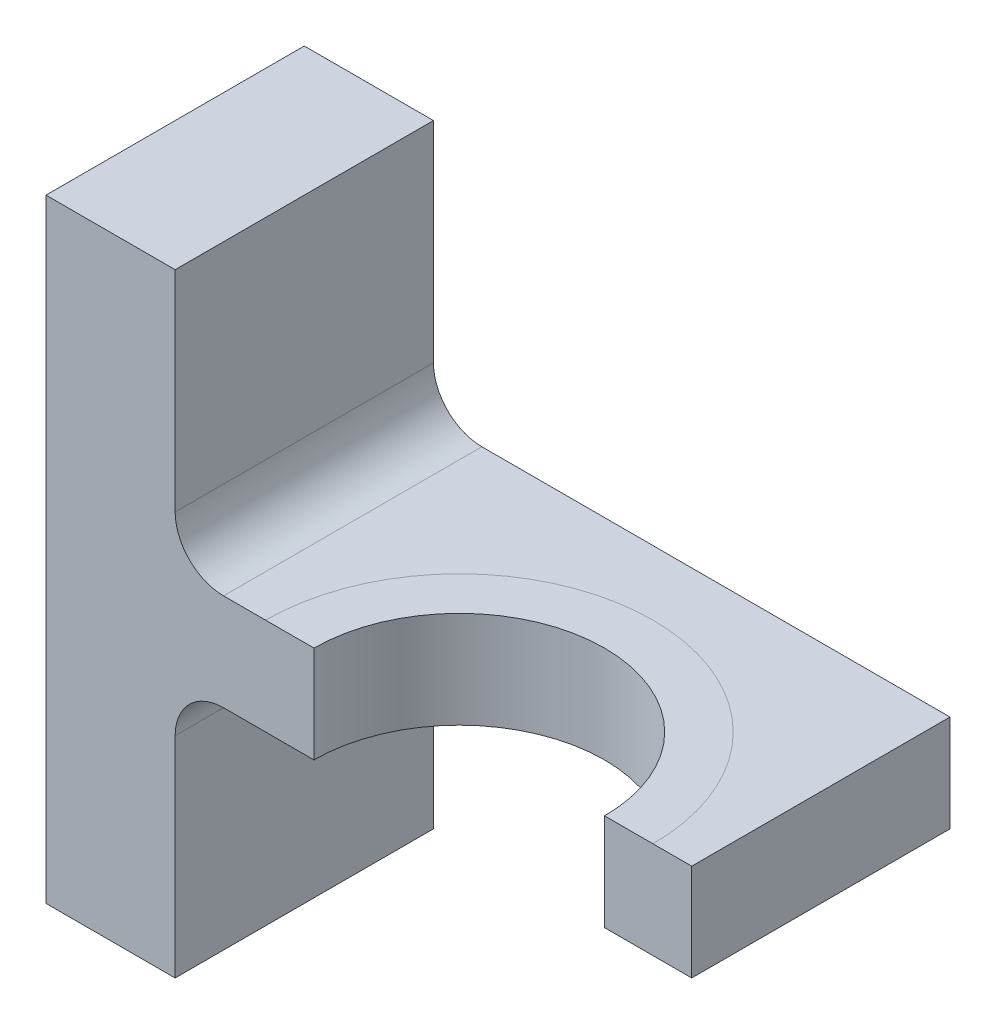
from build123d import *

# Parameters (mm, degrees)
BASE_EXTRUDE_DEPTH      = 50.8
CUT_EXTRUDE8_DEPTH      = 150.494968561
CUT_EXTRUDE8_DEPTH_BACK = 150.494968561
SKETCH6_R               = 28.575
FILLET6_R               = 9.525
SYMMETRY_CUT_DEPTH      = 150.494968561
SYMMETRY_CUT_DEPTH_BACK = 150.494968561


with BuildPart() as part:
    # Sketch1 → Base-Extrude (new, symmetric)
    with BuildSketch(Plane.XY):
        Polygon((0, -60.325), (25.4, -60.325), (25.4, -9.525), (127, -9.525), (127, 9.525), (25.4, 9.525), (25.4, 60.325), (0, 60.325), align=None)
    extrude(amount=BASE_EXTRUDE_DEPTH, both=True)

    # Sketch6 → Cut-Extrude8 (cut, two sides: drawn at the far end of the back side and taken through both)
    with BuildSketch(Plane(origin=(0, 0, 0), x_dir=(1, 0, 0), z_dir=(0, 1, 0)).offset(-CUT_EXTRUDE8_DEPTH_BACK)):
        with Locations(Location((81.28, 0, 0), (0, 0, 270))):
            Circle(SKETCH6_R)
    extrude(amount=CUT_EXTRUDE8_DEPTH + CUT_EXTRUDE8_DEPTH_BACK, mode=Mode.SUBTRACT)

    # Fillet6
    fillet6_edges = [part.edges().sort_by_distance(p)[0] for p in [
        (25.4, 9.525, 0),
        (25.4, -9.525, 0),
    ]]
    fillet(fillet6_edges, radius=FILLET6_R)

    # Sketch9 → symmetry cut (cut, two sides: drawn at the far end of the back side and taken through both)
    with BuildSketch(Plane(origin=(0, 0, 0), x_dir=(1, 0, 0), z_dir=(0, 1, 0)).offset(-SYMMETRY_CUT_DEPTH_BACK)):
        Polygon((-404.71416199, 0), (-41.922574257, 0), (152.827524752, 0), (515.619112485, 0), (515.619112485, -725.583175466), (-404.71416199, -725.583175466), align=None)
    extrude(amount=SYMMETRY_CUT_DEPTH + SYMMETRY_CUT_DEPTH_BACK, mode=Mode.SUBTRACT)


solid = part.part
